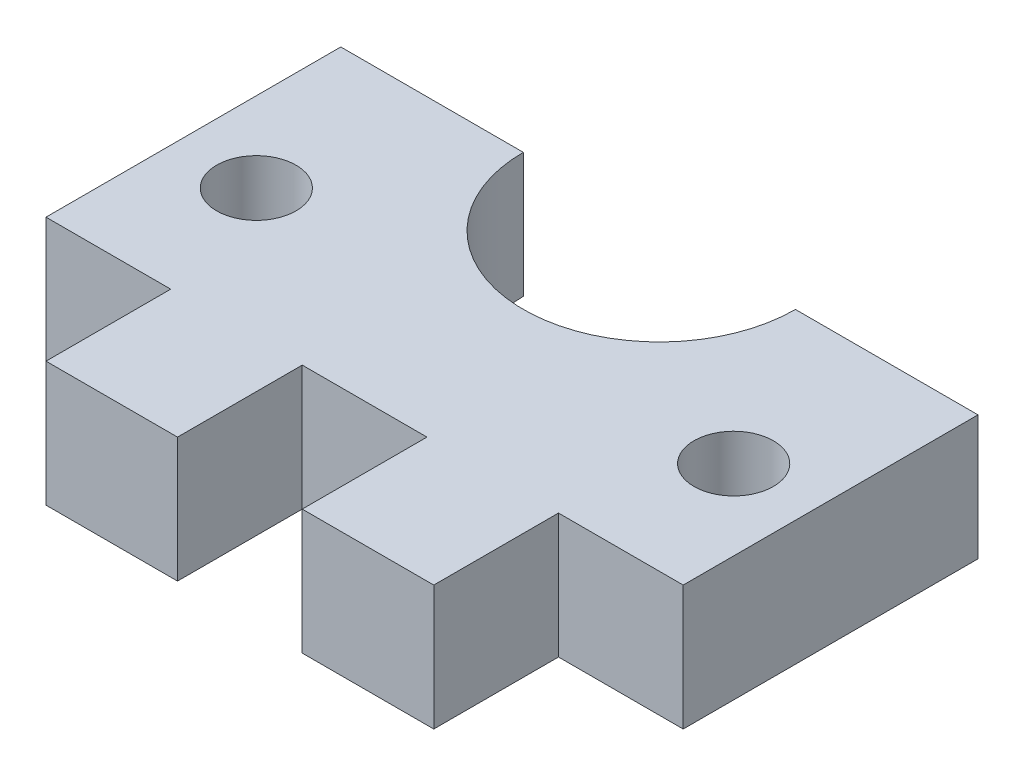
ISO-10303-21;
HEADER;
FILE_DESCRIPTION(('STEP AP214'),'2;1');
FILE_NAME('part.step','',(''),(''),'','','');
FILE_SCHEMA(('AUTOMOTIVE_DESIGN { 1 0 10303 214 1 1 1 1 }'));
ENDSEC;
DATA;
#1=APPLICATION_CONTEXT('core data for automotive mechanical design processes');
#2=APPLICATION_PROTOCOL_DEFINITION('international standard','automotive_design',2000,#1);
#3=PRODUCT_CONTEXT('',#1,'mechanical');
#4=PRODUCT('Part','Part','',(#3));
#5=PRODUCT_RELATED_PRODUCT_CATEGORY('part','',(#4));
#6=PRODUCT_DEFINITION_FORMATION('','',#4);
#7=PRODUCT_DEFINITION_CONTEXT('part definition',#1,'design');
#8=PRODUCT_DEFINITION('design','',#6,#7);
#9=PRODUCT_DEFINITION_SHAPE('','',#8);
#10=(LENGTH_UNIT() NAMED_UNIT(*) SI_UNIT(.MILLI.,.METRE.));
#11=(NAMED_UNIT(*) PLANE_ANGLE_UNIT() SI_UNIT($,.RADIAN.));
#12=(NAMED_UNIT(*) SI_UNIT($,.STERADIAN.) SOLID_ANGLE_UNIT());
#13=UNCERTAINTY_MEASURE_WITH_UNIT(LENGTH_MEASURE(1.E-05),#10,'distance_accuracy_value','');
#14=(GEOMETRIC_REPRESENTATION_CONTEXT(3) GLOBAL_UNCERTAINTY_ASSIGNED_CONTEXT((#13)) GLOBAL_UNIT_ASSIGNED_CONTEXT((#10,
#11,#12)) REPRESENTATION_CONTEXT('',''));
#15=CARTESIAN_POINT('',(0.,0.,0.));
#16=DIRECTION('',(0.,0.,1.));
#17=DIRECTION('',(1.,0.,0.));
#18=AXIS2_PLACEMENT_3D('',#15,#16,#17);
#19=CARTESIAN_POINT('',(-8.55,5.5,-18.5));
#20=DIRECTION('',(0.,1.,0.));
#21=DIRECTION('',(0.,0.,1.));
#22=AXIS2_PLACEMENT_3D('',#19,#20,#21);
#23=PLANE('',#22);
#24=CARTESIAN_POINT('',(-19.075,5.5,-11.25));
#25=DIRECTION('',(0.,1.,0.));
#26=DIRECTION('',(0.,0.,1.));
#27=AXIS2_PLACEMENT_3D('',#24,#25,#26);
#28=CIRCLE('',#27,1.75);
#29=CARTESIAN_POINT('',(-19.075,5.5,-9.5));
#30=VERTEX_POINT('',#29);
#31=EDGE_CURVE('E173',#30,#30,#28,.T.);
#32=ORIENTED_EDGE('',*,*,#31,.F.);
#33=EDGE_LOOP('',(#32));
#34=FACE_BOUND('',#33,.T.);
#35=DIRECTION('',(0.,0.,-1.));
#36=VECTOR('',#35,1.);
#37=CARTESIAN_POINT('',(0.,5.5,0.));
#38=LINE('',#37,#36);
#39=CARTESIAN_POINT('',(0.,5.5,0.));
#40=VERTEX_POINT('',#39);
#41=CARTESIAN_POINT('',(0.,5.5,-5.5));
#42=VERTEX_POINT('',#41);
#43=EDGE_CURVE('E197',#40,#42,#38,.T.);
#44=ORIENTED_EDGE('',*,*,#43,.T.);
#45=DIRECTION('',(1.,0.,0.));
#46=VECTOR('',#45,1.);
#47=CARTESIAN_POINT('',(0.,5.5,-5.5));
#48=LINE('',#47,#46);
#49=CARTESIAN_POINT('',(5.5,5.5,-5.5));
#50=VERTEX_POINT('',#49);
#51=EDGE_CURVE('E114',#42,#50,#48,.T.);
#52=ORIENTED_EDGE('',*,*,#51,.T.);
#53=DIRECTION('',(0.,0.,-1.));
#54=VECTOR('',#53,1.);
#55=CARTESIAN_POINT('',(5.5,5.5,-18.5));
#56=LINE('',#55,#54);
#57=CARTESIAN_POINT('',(5.5,5.5,-18.5));
#58=VERTEX_POINT('',#57);
#59=EDGE_CURVE('E230',#50,#58,#56,.T.);
#60=ORIENTED_EDGE('',*,*,#59,.T.);
#61=DIRECTION('',(-1.,0.,0.));
#62=VECTOR('',#61,1.);
#63=CARTESIAN_POINT('',(-2.55,5.5,-18.5));
#64=LINE('',#63,#62);
#65=CARTESIAN_POINT('',(-2.55,5.5,-18.5));
#66=VERTEX_POINT('',#65);
#67=EDGE_CURVE('E249',#58,#66,#64,.T.);
#68=ORIENTED_EDGE('',*,*,#67,.T.);
#69=CARTESIAN_POINT('',(-8.55,5.5,-18.5));
#70=DIRECTION('',(0.,-1.,0.));
#71=DIRECTION('',(0.,0.,1.));
#72=AXIS2_PLACEMENT_3D('',#69,#70,#71);
#73=CIRCLE('',#72,6.);
#74=CARTESIAN_POINT('',(-14.55,5.5,-18.5));
#75=VERTEX_POINT('',#74);
#76=EDGE_CURVE('E246',#66,#75,#73,.T.);
#77=ORIENTED_EDGE('',*,*,#76,.T.);
#78=DIRECTION('',(-1.,0.,0.));
#79=VECTOR('',#78,1.);
#80=CARTESIAN_POINT('',(-14.55,5.5,-18.5));
#81=LINE('',#80,#79);
#82=CARTESIAN_POINT('',(-22.6,5.5,-18.5));
#83=VERTEX_POINT('',#82);
#84=EDGE_CURVE('E248',#75,#83,#81,.T.);
#85=ORIENTED_EDGE('',*,*,#84,.T.);
#86=DIRECTION('',(0.,0.,1.));
#87=VECTOR('',#86,1.);
#88=CARTESIAN_POINT('',(-22.6,5.5,-18.5));
#89=LINE('',#88,#87);
#90=CARTESIAN_POINT('',(-22.6,5.5,-5.5));
#91=VERTEX_POINT('',#90);
#92=EDGE_CURVE('E251',#83,#91,#89,.T.);
#93=ORIENTED_EDGE('',*,*,#92,.T.);
#94=DIRECTION('',(1.,0.,0.));
#95=VECTOR('',#94,1.);
#96=CARTESIAN_POINT('',(-22.6,5.5,-5.5));
#97=LINE('',#96,#95);
#98=CARTESIAN_POINT('',(-17.1,5.5,-5.5));
#99=VERTEX_POINT('',#98);
#100=EDGE_CURVE('E257',#91,#99,#97,.T.);
#101=ORIENTED_EDGE('',*,*,#100,.T.);
#102=DIRECTION('',(0.,0.,1.));
#103=VECTOR('',#102,1.);
#104=CARTESIAN_POINT('',(-17.1,5.5,-5.5));
#105=LINE('',#104,#103);
#106=CARTESIAN_POINT('',(-17.1,5.5,0.));
#107=VERTEX_POINT('',#106);
#108=EDGE_CURVE('E259',#99,#107,#105,.T.);
#109=ORIENTED_EDGE('',*,*,#108,.T.);
#110=DIRECTION('',(1.,0.,0.));
#111=VECTOR('',#110,1.);
#112=CARTESIAN_POINT('',(-17.1,5.5,0.));
#113=LINE('',#112,#111);
#114=CARTESIAN_POINT('',(-11.3,5.5,0.));
#115=VERTEX_POINT('',#114);
#116=EDGE_CURVE('E261',#107,#115,#113,.T.);
#117=ORIENTED_EDGE('',*,*,#116,.T.);
#118=DIRECTION('',(0.,0.,-1.));
#119=VECTOR('',#118,1.);
#120=CARTESIAN_POINT('',(-11.3,5.5,0.));
#121=LINE('',#120,#119);
#122=CARTESIAN_POINT('',(-11.3,5.5,-5.5));
#123=VERTEX_POINT('',#122);
#124=EDGE_CURVE('E151',#115,#123,#121,.T.);
#125=ORIENTED_EDGE('',*,*,#124,.T.);
#126=DIRECTION('',(1.,0.,0.));
#127=VECTOR('',#126,1.);
#128=CARTESIAN_POINT('',(-11.3,5.5,-5.5));
#129=LINE('',#128,#127);
#130=CARTESIAN_POINT('',(-5.8,5.5,-5.5));
#131=VERTEX_POINT('',#130);
#132=EDGE_CURVE('E145',#123,#131,#129,.T.);
#133=ORIENTED_EDGE('',*,*,#132,.T.);
#134=DIRECTION('',(0.,0.,1.));
#135=VECTOR('',#134,1.);
#136=CARTESIAN_POINT('',(-5.8,5.5,-5.5));
#137=LINE('',#136,#135);
#138=CARTESIAN_POINT('',(-5.8,5.5,0.));
#139=VERTEX_POINT('',#138);
#140=EDGE_CURVE('E149',#131,#139,#137,.T.);
#141=ORIENTED_EDGE('',*,*,#140,.T.);
#142=DIRECTION('',(1.,0.,0.));
#143=VECTOR('',#142,1.);
#144=CARTESIAN_POINT('',(-5.8,5.5,0.));
#145=LINE('',#144,#143);
#146=EDGE_CURVE('E53',#139,#40,#145,.T.);
#147=ORIENTED_EDGE('',*,*,#146,.T.);
#148=EDGE_LOOP('',(#44,#52,#60,#68,#77,#85,#93,#101,#109,#117,#125,#133,#141,#147));
#149=FACE_BOUND('',#148,.T.);
#150=CARTESIAN_POINT('',(1.975,5.5,-11.25));
#151=DIRECTION('',(0.,1.,0.));
#152=DIRECTION('',(0.,0.,1.));
#153=AXIS2_PLACEMENT_3D('',#150,#151,#152);
#154=CIRCLE('',#153,1.75);
#155=CARTESIAN_POINT('',(1.975,5.5,-9.5));
#156=VERTEX_POINT('',#155);
#157=EDGE_CURVE('E303',#156,#156,#154,.T.);
#158=ORIENTED_EDGE('',*,*,#157,.F.);
#159=EDGE_LOOP('',(#158));
#160=FACE_BOUND('',#159,.T.);
#161=ADVANCED_FACE('F36',(#34,#149,#160),#23,.T.);
#162=CARTESIAN_POINT('',(-8.55,0.,-18.5));
#163=DIRECTION('',(0.,1.,0.));
#164=DIRECTION('',(0.,0.,1.));
#165=AXIS2_PLACEMENT_3D('',#162,#163,#164);
#166=PLANE('',#165);
#167=DIRECTION('',(0.,0.,-1.));
#168=VECTOR('',#167,1.);
#169=CARTESIAN_POINT('',(0.,0.,0.));
#170=LINE('',#169,#168);
#171=CARTESIAN_POINT('',(0.,0.,0.));
#172=VERTEX_POINT('',#171);
#173=CARTESIAN_POINT('',(0.,0.,-5.5));
#174=VERTEX_POINT('',#173);
#175=EDGE_CURVE('E169',#172,#174,#170,.T.);
#176=ORIENTED_EDGE('',*,*,#175,.F.);
#177=DIRECTION('',(1.,0.,0.));
#178=VECTOR('',#177,1.);
#179=CARTESIAN_POINT('',(-5.8,0.,0.));
#180=LINE('',#179,#178);
#181=CARTESIAN_POINT('',(-5.8,0.,0.));
#182=VERTEX_POINT('',#181);
#183=EDGE_CURVE('E106',#182,#172,#180,.T.);
#184=ORIENTED_EDGE('',*,*,#183,.F.);
#185=DIRECTION('',(0.,0.,1.));
#186=VECTOR('',#185,1.);
#187=CARTESIAN_POINT('',(-5.8,0.,-5.5));
#188=LINE('',#187,#186);
#189=CARTESIAN_POINT('',(-5.8,0.,-5.5));
#190=VERTEX_POINT('',#189);
#191=EDGE_CURVE('E100',#190,#182,#188,.T.);
#192=ORIENTED_EDGE('',*,*,#191,.F.);
#193=DIRECTION('',(1.,0.,0.));
#194=VECTOR('',#193,1.);
#195=CARTESIAN_POINT('',(-11.3,0.,-5.5));
#196=LINE('',#195,#194);
#197=CARTESIAN_POINT('',(-11.3,0.,-5.5));
#198=VERTEX_POINT('',#197);
#199=EDGE_CURVE('E159',#198,#190,#196,.T.);
#200=ORIENTED_EDGE('',*,*,#199,.F.);
#201=DIRECTION('',(0.,0.,-1.));
#202=VECTOR('',#201,1.);
#203=CARTESIAN_POINT('',(-11.3,0.,0.));
#204=LINE('',#203,#202);
#205=CARTESIAN_POINT('',(-11.3,0.,0.));
#206=VERTEX_POINT('',#205);
#207=EDGE_CURVE('E192',#206,#198,#204,.T.);
#208=ORIENTED_EDGE('',*,*,#207,.F.);
#209=DIRECTION('',(1.,0.,0.));
#210=VECTOR('',#209,1.);
#211=CARTESIAN_POINT('',(-17.1,0.,0.));
#212=LINE('',#211,#210);
#213=CARTESIAN_POINT('',(-17.1,0.,0.));
#214=VERTEX_POINT('',#213);
#215=EDGE_CURVE('E190',#214,#206,#212,.T.);
#216=ORIENTED_EDGE('',*,*,#215,.F.);
#217=DIRECTION('',(0.,0.,1.));
#218=VECTOR('',#217,1.);
#219=CARTESIAN_POINT('',(-17.1,0.,-5.5));
#220=LINE('',#219,#218);
#221=CARTESIAN_POINT('',(-17.1,0.,-5.5));
#222=VERTEX_POINT('',#221);
#223=EDGE_CURVE('E188',#222,#214,#220,.T.);
#224=ORIENTED_EDGE('',*,*,#223,.F.);
#225=DIRECTION('',(1.,0.,0.));
#226=VECTOR('',#225,1.);
#227=CARTESIAN_POINT('',(-19.85,0.,-5.5));
#228=LINE('',#227,#226);
#229=CARTESIAN_POINT('',(-22.6,0.,-5.5));
#230=VERTEX_POINT('',#229);
#231=EDGE_CURVE('E186',#230,#222,#228,.T.);
#232=ORIENTED_EDGE('',*,*,#231,.F.);
#233=DIRECTION('',(0.,0.,1.));
#234=VECTOR('',#233,1.);
#235=CARTESIAN_POINT('',(-22.6,0.,-18.5));
#236=LINE('',#235,#234);
#237=CARTESIAN_POINT('',(-22.6,0.,-18.5));
#238=VERTEX_POINT('',#237);
#239=EDGE_CURVE('E183',#238,#230,#236,.T.);
#240=ORIENTED_EDGE('',*,*,#239,.F.);
#241=DIRECTION('',(-1.,0.,0.));
#242=VECTOR('',#241,1.);
#243=CARTESIAN_POINT('',(-14.55,0.,-18.5));
#244=LINE('',#243,#242);
#245=CARTESIAN_POINT('',(-14.55,0.,-18.5));
#246=VERTEX_POINT('',#245);
#247=EDGE_CURVE('E181',#246,#238,#244,.T.);
#248=ORIENTED_EDGE('',*,*,#247,.F.);
#249=CARTESIAN_POINT('',(-8.55,0.,-18.5));
#250=DIRECTION('',(0.,-1.,0.));
#251=DIRECTION('',(0.,0.,1.));
#252=AXIS2_PLACEMENT_3D('',#249,#250,#251);
#253=CIRCLE('',#252,6.);
#254=CARTESIAN_POINT('',(-2.55,0.,-18.5));
#255=VERTEX_POINT('',#254);
#256=EDGE_CURVE('E179',#255,#246,#253,.T.);
#257=ORIENTED_EDGE('',*,*,#256,.F.);
#258=DIRECTION('',(-1.,0.,0.));
#259=VECTOR('',#258,1.);
#260=CARTESIAN_POINT('',(-2.55,0.,-18.5));
#261=LINE('',#260,#259);
#262=CARTESIAN_POINT('',(5.5,0.,-18.5));
#263=VERTEX_POINT('',#262);
#264=EDGE_CURVE('E177',#263,#255,#261,.T.);
#265=ORIENTED_EDGE('',*,*,#264,.F.);
#266=DIRECTION('',(0.,0.,-1.));
#267=VECTOR('',#266,1.);
#268=CARTESIAN_POINT('',(5.5,0.,-18.5));
#269=LINE('',#268,#267);
#270=CARTESIAN_POINT('',(5.5,0.,-5.5));
#271=VERTEX_POINT('',#270);
#272=EDGE_CURVE('E175',#271,#263,#269,.T.);
#273=ORIENTED_EDGE('',*,*,#272,.F.);
#274=DIRECTION('',(1.,0.,0.));
#275=VECTOR('',#274,1.);
#276=CARTESIAN_POINT('',(5.5,0.,-5.5));
#277=LINE('',#276,#275);
#278=EDGE_CURVE('E172',#174,#271,#277,.T.);
#279=ORIENTED_EDGE('',*,*,#278,.F.);
#280=EDGE_LOOP('',(#176,#184,#192,#200,#208,#216,#224,#232,#240,#248,#257,#265,#273,#279));
#281=FACE_BOUND('',#280,.T.);
#282=CARTESIAN_POINT('',(-19.075,0.,-11.25));
#283=DIRECTION('',(0.,1.,0.));
#284=DIRECTION('',(0.,0.,1.));
#285=AXIS2_PLACEMENT_3D('',#282,#283,#284);
#286=CIRCLE('',#285,1.75);
#287=CARTESIAN_POINT('',(-19.075,0.,-9.5));
#288=VERTEX_POINT('',#287);
#289=EDGE_CURVE('E309',#288,#288,#286,.T.);
#290=ORIENTED_EDGE('',*,*,#289,.T.);
#291=EDGE_LOOP('',(#290));
#292=FACE_BOUND('',#291,.T.);
#293=CARTESIAN_POINT('',(1.975,0.,-11.25));
#294=DIRECTION('',(0.,1.,0.));
#295=DIRECTION('',(0.,0.,1.));
#296=AXIS2_PLACEMENT_3D('',#293,#294,#295);
#297=CIRCLE('',#296,1.75);
#298=CARTESIAN_POINT('',(1.975,0.,-9.5));
#299=VERTEX_POINT('',#298);
#300=EDGE_CURVE('E306',#299,#299,#297,.T.);
#301=ORIENTED_EDGE('',*,*,#300,.T.);
#302=EDGE_LOOP('',(#301));
#303=FACE_BOUND('',#302,.T.);
#304=ADVANCED_FACE('F234',(#281,#292,#303),#166,.F.);
#305=CARTESIAN_POINT('',(0.,5.5,0.));
#306=DIRECTION('',(-1.,0.,0.));
#307=DIRECTION('',(0.,0.,1.));
#308=AXIS2_PLACEMENT_3D('',#305,#306,#307);
#309=PLANE('',#308);
#310=ORIENTED_EDGE('',*,*,#175,.T.);
#311=DIRECTION('',(0.,-1.,0.));
#312=VECTOR('',#311,1.);
#313=CARTESIAN_POINT('',(0.,5.5,-5.5));
#314=LINE('',#313,#312);
#315=EDGE_CURVE('E11',#42,#174,#314,.T.);
#316=ORIENTED_EDGE('',*,*,#315,.F.);
#317=ORIENTED_EDGE('',*,*,#43,.F.);
#318=DIRECTION('',(0.,-1.,0.));
#319=VECTOR('',#318,1.);
#320=CARTESIAN_POINT('',(0.,5.5,0.));
#321=LINE('',#320,#319);
#322=EDGE_CURVE('E165',#40,#172,#321,.T.);
#323=ORIENTED_EDGE('',*,*,#322,.T.);
#324=EDGE_LOOP('',(#310,#316,#317,#323));
#325=FACE_BOUND('',#324,.T.);
#326=ADVANCED_FACE('F38',(#325),#309,.F.);
#327=CARTESIAN_POINT('',(5.5,5.5,-5.5));
#328=DIRECTION('',(0.,0.,-1.));
#329=DIRECTION('',(-1.,0.,0.));
#330=AXIS2_PLACEMENT_3D('',#327,#328,#329);
#331=PLANE('',#330);
#332=ORIENTED_EDGE('',*,*,#278,.T.);
#333=DIRECTION('',(0.,-1.,0.));
#334=VECTOR('',#333,1.);
#335=CARTESIAN_POINT('',(5.5,5.5,-5.5));
#336=LINE('',#335,#334);
#337=EDGE_CURVE('E45',#50,#271,#336,.T.);
#338=ORIENTED_EDGE('',*,*,#337,.F.);
#339=ORIENTED_EDGE('',*,*,#51,.F.);
#340=ORIENTED_EDGE('',*,*,#315,.T.);
#341=EDGE_LOOP('',(#332,#338,#339,#340));
#342=FACE_BOUND('',#341,.T.);
#343=ADVANCED_FACE('F423',(#342),#331,.F.);
#344=CARTESIAN_POINT('',(5.5,5.5,-18.5));
#345=DIRECTION('',(-1.,0.,0.));
#346=DIRECTION('',(0.,0.,1.));
#347=AXIS2_PLACEMENT_3D('',#344,#345,#346);
#348=PLANE('',#347);
#349=ORIENTED_EDGE('',*,*,#272,.T.);
#350=DIRECTION('',(0.,-1.,0.));
#351=VECTOR('',#350,1.);
#352=CARTESIAN_POINT('',(5.5,5.5,-18.5));
#353=LINE('',#352,#351);
#354=EDGE_CURVE('E222',#58,#263,#353,.T.);
#355=ORIENTED_EDGE('',*,*,#354,.F.);
#356=ORIENTED_EDGE('',*,*,#59,.F.);
#357=ORIENTED_EDGE('',*,*,#337,.T.);
#358=EDGE_LOOP('',(#349,#355,#356,#357));
#359=FACE_BOUND('',#358,.T.);
#360=ADVANCED_FACE('F228',(#359),#348,.F.);
#361=CARTESIAN_POINT('',(-2.55,5.5,-18.5));
#362=DIRECTION('',(0.,0.,1.));
#363=DIRECTION('',(1.,0.,0.));
#364=AXIS2_PLACEMENT_3D('',#361,#362,#363);
#365=PLANE('',#364);
#366=ORIENTED_EDGE('',*,*,#264,.T.);
#367=DIRECTION('',(0.,-1.,0.));
#368=VECTOR('',#367,1.);
#369=CARTESIAN_POINT('',(-2.55,5.5,-18.5));
#370=LINE('',#369,#368);
#371=EDGE_CURVE('E219',#66,#255,#370,.T.);
#372=ORIENTED_EDGE('',*,*,#371,.F.);
#373=ORIENTED_EDGE('',*,*,#67,.F.);
#374=ORIENTED_EDGE('',*,*,#354,.T.);
#375=EDGE_LOOP('',(#366,#372,#373,#374));
#376=FACE_BOUND('',#375,.T.);
#377=ADVANCED_FACE('F240',(#376),#365,.F.);
#378=CARTESIAN_POINT('',(-8.55,5.5,-18.5));
#379=DIRECTION('',(0.,-1.,0.));
#380=DIRECTION('',(0.,0.,-1.));
#381=AXIS2_PLACEMENT_3D('',#378,#379,#380);
#382=CYLINDRICAL_SURFACE('',#381,6.);
#383=ORIENTED_EDGE('',*,*,#256,.T.);
#384=DIRECTION('',(0.,-1.,0.));
#385=VECTOR('',#384,1.);
#386=CARTESIAN_POINT('',(-14.55,5.5,-18.5));
#387=LINE('',#386,#385);
#388=EDGE_CURVE('E216',#75,#246,#387,.T.);
#389=ORIENTED_EDGE('',*,*,#388,.F.);
#390=ORIENTED_EDGE('',*,*,#76,.F.);
#391=ORIENTED_EDGE('',*,*,#371,.T.);
#392=EDGE_LOOP('',(#383,#389,#390,#391));
#393=FACE_BOUND('',#392,.T.);
#394=ADVANCED_FACE('F244',(#393),#382,.F.);
#395=CARTESIAN_POINT('',(-14.55,5.5,-18.5));
#396=DIRECTION('',(0.,0.,1.));
#397=DIRECTION('',(1.,0.,0.));
#398=AXIS2_PLACEMENT_3D('',#395,#396,#397);
#399=PLANE('',#398);
#400=ORIENTED_EDGE('',*,*,#247,.T.);
#401=DIRECTION('',(0.,-1.,0.));
#402=VECTOR('',#401,1.);
#403=CARTESIAN_POINT('',(-22.6,5.5,-18.5));
#404=LINE('',#403,#402);
#405=EDGE_CURVE('E213',#83,#238,#404,.T.);
#406=ORIENTED_EDGE('',*,*,#405,.F.);
#407=ORIENTED_EDGE('',*,*,#84,.F.);
#408=ORIENTED_EDGE('',*,*,#388,.T.);
#409=EDGE_LOOP('',(#400,#406,#407,#408));
#410=FACE_BOUND('',#409,.T.);
#411=ADVANCED_FACE('F388',(#410),#399,.F.);
#412=CARTESIAN_POINT('',(-22.6,5.5,-18.5));
#413=DIRECTION('',(1.,0.,0.));
#414=DIRECTION('',(0.,0.,-1.));
#415=AXIS2_PLACEMENT_3D('',#412,#413,#414);
#416=PLANE('',#415);
#417=ORIENTED_EDGE('',*,*,#239,.T.);
#418=DIRECTION('',(0.,-1.,0.));
#419=VECTOR('',#418,1.);
#420=CARTESIAN_POINT('',(-22.6,5.5,-5.5));
#421=LINE('',#420,#419);
#422=EDGE_CURVE('E210',#91,#230,#421,.T.);
#423=ORIENTED_EDGE('',*,*,#422,.F.);
#424=ORIENTED_EDGE('',*,*,#92,.F.);
#425=ORIENTED_EDGE('',*,*,#405,.T.);
#426=EDGE_LOOP('',(#417,#423,#424,#425));
#427=FACE_BOUND('',#426,.T.);
#428=ADVANCED_FACE('F377',(#427),#416,.F.);
#429=CARTESIAN_POINT('',(-19.85,5.5,-5.5));
#430=DIRECTION('',(0.,0.,-1.));
#431=DIRECTION('',(-1.,0.,0.));
#432=AXIS2_PLACEMENT_3D('',#429,#430,#431);
#433=PLANE('',#432);
#434=ORIENTED_EDGE('',*,*,#231,.T.);
#435=DIRECTION('',(0.,-1.,0.));
#436=VECTOR('',#435,1.);
#437=CARTESIAN_POINT('',(-17.1,5.5,-5.5));
#438=LINE('',#437,#436);
#439=EDGE_CURVE('E207',#99,#222,#438,.T.);
#440=ORIENTED_EDGE('',*,*,#439,.F.);
#441=ORIENTED_EDGE('',*,*,#100,.F.);
#442=ORIENTED_EDGE('',*,*,#422,.T.);
#443=EDGE_LOOP('',(#434,#440,#441,#442));
#444=FACE_BOUND('',#443,.T.);
#445=ADVANCED_FACE('F367',(#444),#433,.F.);
#446=CARTESIAN_POINT('',(-17.1,5.5,-5.5));
#447=DIRECTION('',(1.,0.,0.));
#448=DIRECTION('',(0.,0.,-1.));
#449=AXIS2_PLACEMENT_3D('',#446,#447,#448);
#450=PLANE('',#449);
#451=ORIENTED_EDGE('',*,*,#223,.T.);
#452=DIRECTION('',(0.,-1.,0.));
#453=VECTOR('',#452,1.);
#454=CARTESIAN_POINT('',(-17.1,5.5,0.));
#455=LINE('',#454,#453);
#456=EDGE_CURVE('E204',#107,#214,#455,.T.);
#457=ORIENTED_EDGE('',*,*,#456,.F.);
#458=ORIENTED_EDGE('',*,*,#108,.F.);
#459=ORIENTED_EDGE('',*,*,#439,.T.);
#460=EDGE_LOOP('',(#451,#457,#458,#459));
#461=FACE_BOUND('',#460,.T.);
#462=ADVANCED_FACE('F358',(#461),#450,.F.);
#463=CARTESIAN_POINT('',(-17.1,5.5,0.));
#464=DIRECTION('',(0.,0.,-1.));
#465=DIRECTION('',(-1.,0.,0.));
#466=AXIS2_PLACEMENT_3D('',#463,#464,#465);
#467=PLANE('',#466);
#468=ORIENTED_EDGE('',*,*,#215,.T.);
#469=DIRECTION('',(0.,-1.,0.));
#470=VECTOR('',#469,1.);
#471=CARTESIAN_POINT('',(-11.3,5.5,0.));
#472=LINE('',#471,#470);
#473=EDGE_CURVE('E201',#115,#206,#472,.T.);
#474=ORIENTED_EDGE('',*,*,#473,.F.);
#475=ORIENTED_EDGE('',*,*,#116,.F.);
#476=ORIENTED_EDGE('',*,*,#456,.T.);
#477=EDGE_LOOP('',(#468,#474,#475,#476));
#478=FACE_BOUND('',#477,.T.);
#479=ADVANCED_FACE('F267',(#478),#467,.F.);
#480=CARTESIAN_POINT('',(-11.3,5.5,0.));
#481=DIRECTION('',(-1.,0.,0.));
#482=DIRECTION('',(0.,0.,1.));
#483=AXIS2_PLACEMENT_3D('',#480,#481,#482);
#484=PLANE('',#483);
#485=ORIENTED_EDGE('',*,*,#207,.T.);
#486=DIRECTION('',(0.,-1.,0.));
#487=VECTOR('',#486,1.);
#488=CARTESIAN_POINT('',(-11.3,5.5,-5.5));
#489=LINE('',#488,#487);
#490=EDGE_CURVE('E160',#123,#198,#489,.T.);
#491=ORIENTED_EDGE('',*,*,#490,.F.);
#492=ORIENTED_EDGE('',*,*,#124,.F.);
#493=ORIENTED_EDGE('',*,*,#473,.T.);
#494=EDGE_LOOP('',(#485,#491,#492,#493));
#495=FACE_BOUND('',#494,.T.);
#496=ADVANCED_FACE('F271',(#495),#484,.F.);
#497=CARTESIAN_POINT('',(-11.3,5.5,-5.5));
#498=DIRECTION('',(0.,0.,-1.));
#499=DIRECTION('',(-1.,0.,0.));
#500=AXIS2_PLACEMENT_3D('',#497,#498,#499);
#501=PLANE('',#500);
#502=ORIENTED_EDGE('',*,*,#199,.T.);
#503=DIRECTION('',(0.,-1.,0.));
#504=VECTOR('',#503,1.);
#505=CARTESIAN_POINT('',(-5.8,5.5,-5.5));
#506=LINE('',#505,#504);
#507=EDGE_CURVE('E156',#131,#190,#506,.T.);
#508=ORIENTED_EDGE('',*,*,#507,.F.);
#509=ORIENTED_EDGE('',*,*,#132,.F.);
#510=ORIENTED_EDGE('',*,*,#490,.T.);
#511=EDGE_LOOP('',(#502,#508,#509,#510));
#512=FACE_BOUND('',#511,.T.);
#513=ADVANCED_FACE('F157',(#512),#501,.F.);
#514=CARTESIAN_POINT('',(-5.8,5.5,-5.5));
#515=DIRECTION('',(1.,0.,0.));
#516=DIRECTION('',(0.,0.,-1.));
#517=AXIS2_PLACEMENT_3D('',#514,#515,#516);
#518=PLANE('',#517);
#519=ORIENTED_EDGE('',*,*,#191,.T.);
#520=DIRECTION('',(0.,-1.,0.));
#521=VECTOR('',#520,1.);
#522=CARTESIAN_POINT('',(-5.8,5.5,0.));
#523=LINE('',#522,#521);
#524=EDGE_CURVE('E161',#139,#182,#523,.T.);
#525=ORIENTED_EDGE('',*,*,#524,.F.);
#526=ORIENTED_EDGE('',*,*,#140,.F.);
#527=ORIENTED_EDGE('',*,*,#507,.T.);
#528=EDGE_LOOP('',(#519,#525,#526,#527));
#529=FACE_BOUND('',#528,.T.);
#530=ADVANCED_FACE('F163',(#529),#518,.F.);
#531=CARTESIAN_POINT('',(-5.8,5.5,0.));
#532=DIRECTION('',(0.,0.,-1.));
#533=DIRECTION('',(-1.,0.,0.));
#534=AXIS2_PLACEMENT_3D('',#531,#532,#533);
#535=PLANE('',#534);
#536=ORIENTED_EDGE('',*,*,#183,.T.);
#537=ORIENTED_EDGE('',*,*,#322,.F.);
#538=ORIENTED_EDGE('',*,*,#146,.F.);
#539=ORIENTED_EDGE('',*,*,#524,.T.);
#540=EDGE_LOOP('',(#536,#537,#538,#539));
#541=FACE_BOUND('',#540,.T.);
#542=ADVANCED_FACE('F275',(#541),#535,.F.);
#543=CARTESIAN_POINT('',(-19.075,5.5,-11.25));
#544=DIRECTION('',(0.,-1.,0.));
#545=DIRECTION('',(0.,0.,-1.));
#546=AXIS2_PLACEMENT_3D('',#543,#544,#545);
#547=CYLINDRICAL_SURFACE('',#546,1.75);
#548=ORIENTED_EDGE('',*,*,#31,.T.);
#549=EDGE_LOOP('',(#548));
#550=FACE_BOUND('',#549,.T.);
#551=ORIENTED_EDGE('',*,*,#289,.F.);
#552=EDGE_LOOP('',(#551));
#553=FACE_BOUND('',#552,.T.);
#554=ADVANCED_FACE('F277',(#550,#553),#547,.F.);
#555=CARTESIAN_POINT('',(1.975,5.5,-11.25));
#556=DIRECTION('',(0.,-1.,0.));
#557=DIRECTION('',(0.,0.,-1.));
#558=AXIS2_PLACEMENT_3D('',#555,#556,#557);
#559=CYLINDRICAL_SURFACE('',#558,1.75);
#560=ORIENTED_EDGE('',*,*,#157,.T.);
#561=EDGE_LOOP('',(#560));
#562=FACE_BOUND('',#561,.T.);
#563=ORIENTED_EDGE('',*,*,#300,.F.);
#564=EDGE_LOOP('',(#563));
#565=FACE_BOUND('',#564,.T.);
#566=ADVANCED_FACE('F283',(#562,#565),#559,.F.);
#567=CLOSED_SHELL('',(#161,#304,#326,#343,#360,#377,#394,#411,#428,#445,#462,#479,#496,#513,
#530,#542,#554,#566));
#568=MANIFOLD_SOLID_BREP('B2',#567);
#569=ADVANCED_BREP_SHAPE_REPRESENTATION('',(#18,#568),#14);
#570=SHAPE_DEFINITION_REPRESENTATION(#9,#569);
ENDSEC;
END-ISO-10303-21;
